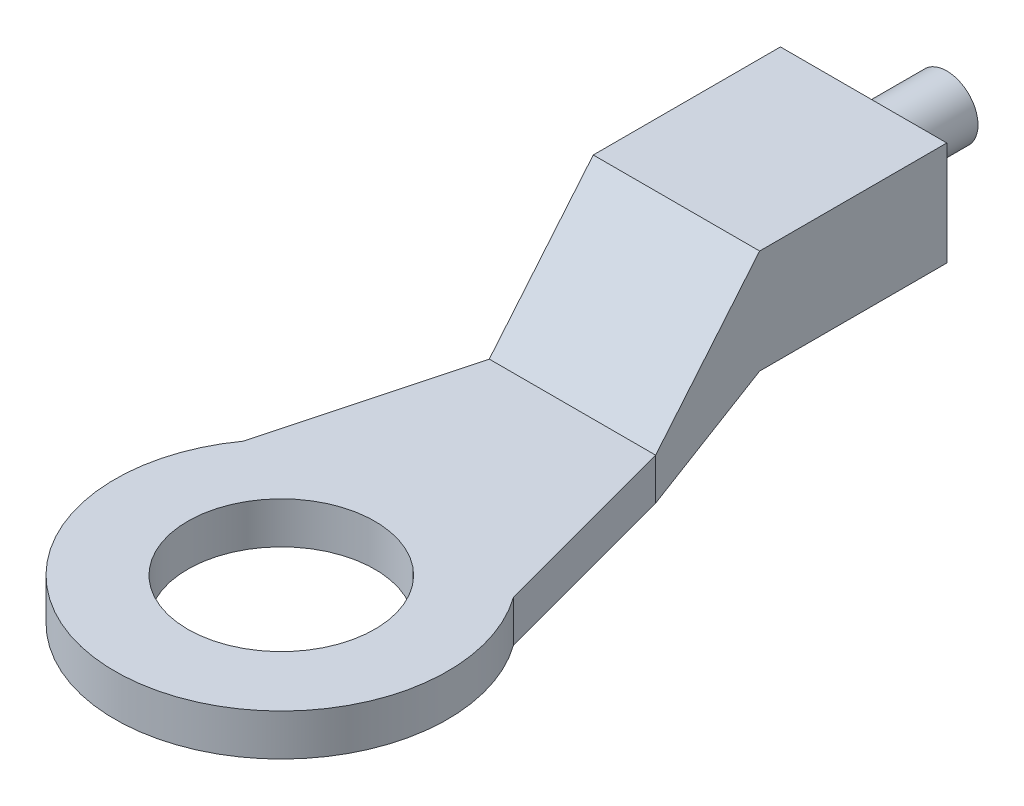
from build123d import *

# Parameters (mm, degrees)
SKIZZE1_R                    = 2.25
LINEAR_AUSTRAGEN1_DEPTH      = 1
LINEAR_AUSTRAGEN2_DEPTH      = 2
LINEAR_AUSTRAGEN2_DEPTH_BACK = 2
SKIZZE3_R                    = 0.75
LINEAR_AUSTRAGEN3_DEPTH      = 2


with BuildPart() as part:
    # Skizze1 → Linear austragen1 (new body)
    with BuildSketch(Plane(origin=(0, 0, 0), x_dir=(1, 0, 0), z_dir=(0, 1, 0))):
        with BuildLine():
            Line((-3.25, 2.331844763), (-2, 7))
            Line((-2, 7), (2, 7))
            Line((2, 7), (3.25, 2.331844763))
            ThreePointArc((3.25, 2.331844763), (0, -4), (-3.25, 2.331844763))
        make_face()
        with Locations(Location((0, 0, 0), (0, 0, 270))):
            Circle(SKIZZE1_R, mode=Mode.SUBTRACT)
    extrude(amount=LINEAR_AUSTRAGEN1_DEPTH)

    # Skizze2 → Linear austragen2 (add, two sides: drawn at the far end of the back side and taken through both)
    with BuildSketch(Plane(origin=(0, 0, 0), x_dir=(0, 0, -1), z_dir=(1, 0, 0)).offset(-LINEAR_AUSTRAGEN2_DEPTH_BACK)):
        Polygon((7, 1), (9.5, 4), (14, 4), (14, 1.5), (9.5, 1.5), (7, 0), align=None)
    extrude(amount=LINEAR_AUSTRAGEN2_DEPTH + LINEAR_AUSTRAGEN2_DEPTH_BACK)

    # Skizze3 → Linear austragen3 (add)
    with BuildSketch(Plane(origin=(0, 0, -14), x_dir=(-1, 0, 0), z_dir=(0, 0, -1))):
        with Locations(Location((0, 2.75, 0), (0, 0, 180))):
            Circle(SKIZZE3_R)
    extrude(amount=LINEAR_AUSTRAGEN3_DEPTH)


solid = part.part
